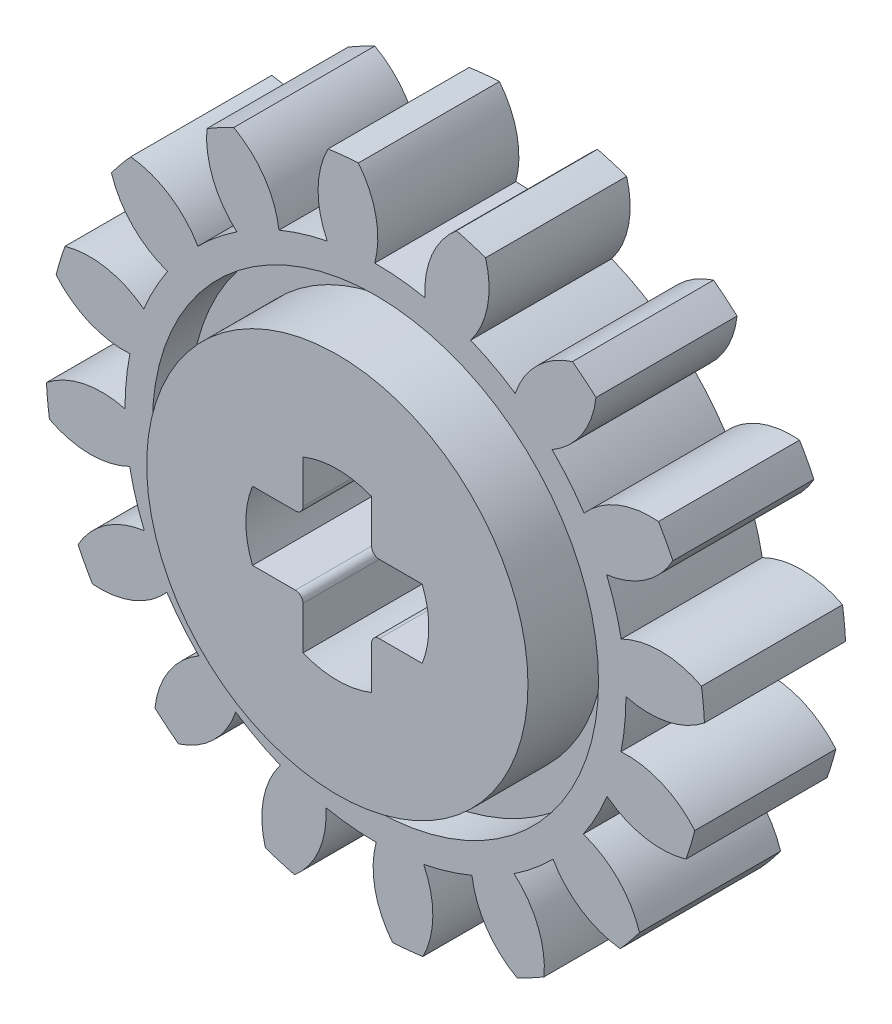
from build123d import *

# Parameters (mm, degrees)
EXTRUDE_1859_DEPTH  = 1.85
SKETCH_2_R          = 5.85
CUT_EXTRUDE_1_DEPTH = 1
CUT_EXTRUDE_START   = -1
SKETCH_3_R          = 5.85
CUT_EXTRUDE_2_DEPTH = 1
SKETCH1_R           = 5
BOSS_EXTRUDE1_DEPTH = 2
BOSS_EXTRUDE2_START = 2
SKETCH2_R           = 5
BOSS_EXTRUDE2_DEPTH = 2
CUT_EXTRUDE1_DEPTH  = 295.440226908
FILLET1_R           = 0.2


with BuildPart() as part:
    # Sketch 1 → Extrude 1859 (new, symmetric)
    with BuildSketch(Plane.XY):
        with BuildLine():
            ThreePointArc((212.407067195, 176.513804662), (212.318855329, 176.833426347), (212.246883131, 177.157091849))
            ThreePointArc((212.246883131, 177.157091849), (211.192758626, 176.91596467), (210.143389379, 177.177010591))
            ThreePointArc((210.143389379, 177.177010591), (210.095006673, 177.573875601), (210.065035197, 177.972553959))
            ThreePointArc((210.065035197, 177.972553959), (211.043313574, 178.43330574), (212.124224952, 178.40246124))
            ThreePointArc((212.124224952, 178.40246124), (212.15583202, 179.064638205), (212.25401659, 179.720257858))
            ThreePointArc((212.25401659, 179.720257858), (211.187857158, 179.900881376), (210.318264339, 180.543632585))
            ThreePointArc((210.318264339, 180.543632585), (210.42543821, 180.928803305), (210.55031578, 181.308603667))
            ThreePointArc((210.55031578, 181.308603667), (211.630449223, 181.35991188), (212.617277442, 180.917768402))
            ThreePointArc((212.617277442, 180.917768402), (212.899882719, 181.517444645), (213.241488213, 182.085584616))
            ThreePointArc((213.241488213, 182.085584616), (212.325606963, 182.660460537), (211.768178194, 183.587063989))
            ThreePointArc((211.768178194, 183.587063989), (212.014592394, 183.901901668), (212.275307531, 184.205002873))
            ThreePointArc((212.275307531, 184.205002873), (213.292855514, 183.839056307), (214.035364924, 183.052926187))
            ThreePointArc((214.035364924, 183.052926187), (214.525944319, 183.498806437), (215.058964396, 183.892972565))
            ThreePointArc((215.058964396, 183.892972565), (214.432795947, 184.774581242), (214.272394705, 185.84396996))
            ThreePointArc((214.272394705, 185.84396996), (214.620534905, 186.040543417), (214.977396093, 186.220801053))
            ThreePointArc((214.977396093, 186.220801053), (215.77744616, 185.493311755), (216.162596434, 184.482876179))
            ThreePointArc((216.162596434, 184.482876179), (216.78646368, 184.707079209), (217.429750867, 184.867263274))
            ThreePointArc((217.429750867, 184.867263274), (217.188623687, 185.921387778), (217.449669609, 186.970757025))
            ThreePointArc((217.449669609, 186.970757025), (217.846534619, 187.019139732), (218.245212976, 187.049111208))
            ThreePointArc((218.245212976, 187.049111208), (218.705964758, 186.07083283), (218.675120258, 184.989921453))
            ThreePointArc((218.675120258, 184.989921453), (219.337297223, 184.958314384), (219.992916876, 184.860129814))
            ThreePointArc((219.992916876, 184.860129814), (220.173540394, 185.926289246), (220.816291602, 186.795882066))
            ThreePointArc((220.816291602, 186.795882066), (221.201462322, 186.688708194), (221.581262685, 186.563830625))
            ThreePointArc((221.581262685, 186.563830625), (221.632570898, 185.483697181), (221.19042742, 184.496868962))
            ThreePointArc((221.19042742, 184.496868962), (221.790103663, 184.214263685), (222.358243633, 183.872658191))
            ThreePointArc((222.358243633, 183.872658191), (222.933119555, 184.788539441), (223.859723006, 185.34596821))
            ThreePointArc((223.859723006, 185.34596821), (224.174560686, 185.09955401), (224.47766189, 184.838838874))
            ThreePointArc((224.47766189, 184.838838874), (224.111715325, 183.82129089), (223.325585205, 183.07878148))
            ThreePointArc((223.325585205, 183.07878148), (223.771465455, 182.588202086), (224.165631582, 182.055182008))
            ThreePointArc((224.165631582, 182.055182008), (225.04724026, 182.681350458), (226.116628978, 182.841751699))
            ThreePointArc((226.116628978, 182.841751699), (226.313202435, 182.493611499), (226.493460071, 182.136750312))
            ThreePointArc((226.493460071, 182.136750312), (225.765970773, 181.336700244), (224.755535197, 180.95154997))
            ThreePointArc((224.755535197, 180.95154997), (224.979738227, 180.327682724), (225.139922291, 179.684395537))
            ThreePointArc((225.139922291, 179.684395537), (226.194046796, 179.925522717), (227.243416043, 179.664476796))
            ThreePointArc((227.243416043, 179.664476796), (227.291798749, 179.267611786), (227.321770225, 178.868933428))
            ThreePointArc((227.321770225, 178.868933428), (226.343491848, 178.408181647), (225.26258047, 178.439026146))
            ThreePointArc((225.26258047, 178.439026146), (225.230973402, 177.776849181), (225.132788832, 177.121229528))
            ThreePointArc((225.132788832, 177.121229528), (226.198948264, 176.940606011), (227.068541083, 176.297854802))
            ThreePointArc((227.068541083, 176.297854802), (226.961367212, 175.912684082), (226.836489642, 175.53288372))
            ThreePointArc((226.836489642, 175.53288372), (225.756356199, 175.481575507), (224.76952798, 175.923718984))
            ThreePointArc((224.76952798, 175.923718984), (224.486922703, 175.324042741), (224.145317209, 174.755902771))
            ThreePointArc((224.145317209, 174.755902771), (225.061198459, 174.181026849), (225.618627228, 173.254423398))
            ThreePointArc((225.618627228, 173.254423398), (225.372213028, 172.939585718), (225.111497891, 172.636484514))
            ThreePointArc((225.111497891, 172.636484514), (224.093949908, 173.00243108), (223.351440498, 173.788561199))
            ThreePointArc((223.351440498, 173.788561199), (222.860861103, 173.342680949), (222.327841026, 172.948514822))
            ThreePointArc((222.327841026, 172.948514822), (222.954009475, 172.066906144), (223.114410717, 170.997517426))
            ThreePointArc((223.114410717, 170.997517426), (222.766270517, 170.800943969), (222.40940933, 170.620686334))
            ThreePointArc((222.40940933, 170.620686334), (221.609359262, 171.348175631), (221.224208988, 172.358611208))
            ThreePointArc((221.224208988, 172.358611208), (220.600341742, 172.134408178), (219.957054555, 171.974224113))
            ThreePointArc((219.957054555, 171.974224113), (220.198181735, 170.920099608), (219.937135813, 169.870730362))
            ThreePointArc((219.937135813, 169.870730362), (219.540270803, 169.822347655), (219.141592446, 169.792376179))
            ThreePointArc((219.141592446, 169.792376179), (218.680840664, 170.770654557), (218.711685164, 171.851565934))
            ThreePointArc((218.711685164, 171.851565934), (218.049508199, 171.883173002), (217.393888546, 171.981357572))
            ThreePointArc((217.393888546, 171.981357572), (217.213265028, 170.915198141), (216.57051382, 170.045605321))
            ThreePointArc((216.57051382, 170.045605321), (216.1853431, 170.152779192), (215.805542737, 170.277656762))
            ThreePointArc((215.805542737, 170.277656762), (215.754234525, 171.357790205), (216.196378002, 172.344618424))
            ThreePointArc((216.196378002, 172.344618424), (215.596701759, 172.627223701), (215.028561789, 172.968829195))
            ThreePointArc((215.028561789, 172.968829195), (214.453685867, 172.052947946), (213.527082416, 171.495519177))
            ThreePointArc((213.527082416, 171.495519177), (213.212244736, 171.741933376), (212.909143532, 172.002648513))
            ThreePointArc((212.909143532, 172.002648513), (213.275090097, 173.020196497), (214.061220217, 173.762705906))
            ThreePointArc((214.061220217, 173.762705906), (213.615339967, 174.253285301), (213.22117384, 174.786305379))
            ThreePointArc((213.22117384, 174.786305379), (212.339565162, 174.160136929), (211.270176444, 173.999735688))
            ThreePointArc((211.270176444, 173.999735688), (211.073602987, 174.347875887), (210.893345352, 174.704737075))
            ThreePointArc((210.893345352, 174.704737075), (211.620834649, 175.504787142), (212.631270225, 175.889937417))
            ThreePointArc((212.631270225, 175.889937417), (212.511294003, 176.199041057), (212.407067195, 176.513804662))
        make_face()
    extrude(amount=EXTRUDE_1859_DEPTH, both=True)

    # Sketch 2 → Cut-Extrude 1 (cut)
    with BuildSketch(Plane.XY.offset(1.85)):
        with Locations((218.693402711, 178.420743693)):
            Circle(SKETCH_2_R)
    extrude(amount=-CUT_EXTRUDE_1_DEPTH, mode=Mode.SUBTRACT)

    # Sketch 3 → Cut-Extrude 2 (cut)
    with BuildSketch(Plane(origin=(0, 0, -1.85), x_dir=(-1, 0, 0), z_dir=(0, 0, -1)).offset(CUT_EXTRUDE_START)):
        with Locations(Location((-218.693402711, 178.420743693, 0), (0, 0, 180))):
            Circle(SKETCH_3_R)
    extrude(amount=CUT_EXTRUDE_2_DEPTH, mode=Mode.SUBTRACT)

    # Sketch1 → Boss-Extrude1 (add)
    with BuildSketch(Plane(origin=(0, 0, -0.85), x_dir=(-1, 0, 0), z_dir=(0, 0, -1))):
        with Locations((-218.693402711, 178.420743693)):
            Circle(SKETCH1_R)
    extrude(amount=BOSS_EXTRUDE1_DEPTH)

    # Sketch2 → Boss-Extrude2 (add)
    with BuildSketch(Plane.XY.offset(0.85).offset(BOSS_EXTRUDE2_START)):
        with Locations(Location((218.693402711, 178.420743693, 0), (0, 0, 180))):
            Circle(SKETCH2_R)
    extrude(amount=-BOSS_EXTRUDE2_DEPTH)

    # Sketch3 → Cut-Extrude1 (cut, through all)
    with BuildSketch(Plane.XY.offset(2.85)):
        with BuildLine():
            Line((216.468543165, 179.320743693), (217.793402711, 179.320743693))
            Line((217.793402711, 179.320743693), (217.793402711, 180.645603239))
            ThreePointArc((217.793402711, 180.645603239), (218.693402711, 180.820743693), (219.593402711, 180.645603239))
            Line((219.593402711, 180.645603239), (219.593402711, 179.320743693))
            Line((219.593402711, 179.320743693), (220.918262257, 179.320743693))
            ThreePointArc((220.918262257, 179.320743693), (221.093402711, 178.420743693), (220.918262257, 177.520743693))
            Line((220.918262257, 177.520743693), (219.593402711, 177.520743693))
            Line((219.593402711, 177.520743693), (219.593402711, 176.195884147))
            ThreePointArc((219.593402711, 176.195884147), (218.693402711, 176.020743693), (217.793402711, 176.195884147))
            Line((217.793402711, 176.195884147), (217.793402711, 177.520743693))
            Line((217.793402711, 177.520743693), (216.468543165, 177.520743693))
            ThreePointArc((216.468543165, 177.520743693), (216.293402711, 178.420743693), (216.468543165, 179.320743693))
        make_face()
    extrude(amount=-CUT_EXTRUDE1_DEPTH, mode=Mode.SUBTRACT)

    # Fillet1
    fillet1_edges = [part.edges().sort_by_distance(p)[0] for p in [
        (217.793402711, 177.520743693, 0),
        (217.793402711, 179.320743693, 0),
        (219.593402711, 179.320743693, 0),
        (219.593402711, 177.520743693, 0),
    ]]
    fillet(fillet1_edges, radius=FILLET1_R)


solid = part.part
